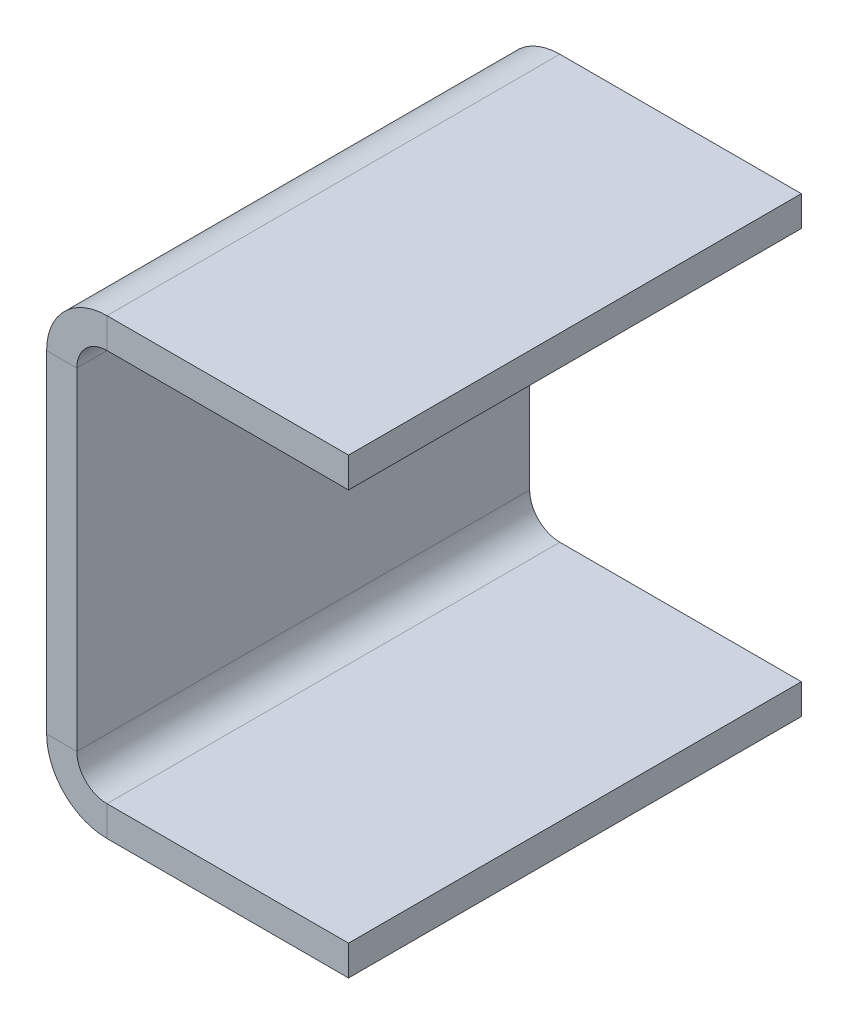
ISO-10303-21;
HEADER;
FILE_DESCRIPTION(('STEP AP214'),'2;1');
FILE_NAME('part.step','',(''),(''),'','','');
FILE_SCHEMA(('AUTOMOTIVE_DESIGN { 1 0 10303 214 1 1 1 1 }'));
ENDSEC;
DATA;
#1=APPLICATION_CONTEXT('core data for automotive mechanical design processes');
#2=APPLICATION_PROTOCOL_DEFINITION('international standard','automotive_design',2000,#1);
#3=PRODUCT_CONTEXT('',#1,'mechanical');
#4=PRODUCT('Part','Part','',(#3));
#5=PRODUCT_RELATED_PRODUCT_CATEGORY('part','',(#4));
#6=PRODUCT_DEFINITION_FORMATION('','',#4);
#7=PRODUCT_DEFINITION_CONTEXT('part definition',#1,'design');
#8=PRODUCT_DEFINITION('design','',#6,#7);
#9=PRODUCT_DEFINITION_SHAPE('','',#8);
#10=(LENGTH_UNIT() NAMED_UNIT(*) SI_UNIT(.MILLI.,.METRE.));
#11=(NAMED_UNIT(*) PLANE_ANGLE_UNIT() SI_UNIT($,.RADIAN.));
#12=(NAMED_UNIT(*) SI_UNIT($,.STERADIAN.) SOLID_ANGLE_UNIT());
#13=UNCERTAINTY_MEASURE_WITH_UNIT(LENGTH_MEASURE(1.E-05),#10,'distance_accuracy_value','');
#14=(GEOMETRIC_REPRESENTATION_CONTEXT(3) GLOBAL_UNCERTAINTY_ASSIGNED_CONTEXT((#13)) GLOBAL_UNIT_ASSIGNED_CONTEXT((#10,
#11,#12)) REPRESENTATION_CONTEXT('',''));
#15=CARTESIAN_POINT('',(0.,0.,0.));
#16=DIRECTION('',(0.,0.,1.));
#17=DIRECTION('',(1.,0.,0.));
#18=AXIS2_PLACEMENT_3D('',#15,#16,#17);
#19=CARTESIAN_POINT('',(4.,15.,15.));
#20=DIRECTION('',(0.,0.,1.));
#21=DIRECTION('',(1.,0.,0.));
#22=AXIS2_PLACEMENT_3D('',#19,#20,#21);
#23=PLANE('',#22);
#24=DIRECTION('',(0.,-1.,0.));
#25=VECTOR('',#24,1.);
#26=CARTESIAN_POINT('',(4.,15.,15.));
#27=LINE('',#26,#25);
#28=CARTESIAN_POINT('',(4.,15.,15.));
#29=VERTEX_POINT('',#28);
#30=CARTESIAN_POINT('',(4.,13.,15.));
#31=VERTEX_POINT('',#30);
#32=EDGE_CURVE('E11',#29,#31,#27,.T.);
#33=ORIENTED_EDGE('',*,*,#32,.F.);
#34=CARTESIAN_POINT('',(4.,11.,15.));
#35=DIRECTION('',(0.,0.,-1.));
#36=DIRECTION('',(-1.,0.,0.));
#37=AXIS2_PLACEMENT_3D('',#34,#35,#36);
#38=CIRCLE('',#37,4.);
#39=CARTESIAN_POINT('',(0.,11.,15.));
#40=VERTEX_POINT('',#39);
#41=EDGE_CURVE('E197',#29,#40,#38,.F.);
#42=ORIENTED_EDGE('',*,*,#41,.T.);
#43=DIRECTION('',(-1.,0.,0.));
#44=VECTOR('',#43,1.);
#45=CARTESIAN_POINT('',(2.,11.,15.));
#46=LINE('',#45,#44);
#47=CARTESIAN_POINT('',(2.,11.,15.));
#48=VERTEX_POINT('',#47);
#49=EDGE_CURVE('E38',#48,#40,#46,.T.);
#50=ORIENTED_EDGE('',*,*,#49,.F.);
#51=CARTESIAN_POINT('',(4.,11.,15.));
#52=DIRECTION('',(0.,0.,1.));
#53=DIRECTION('',(1.,0.,0.));
#54=AXIS2_PLACEMENT_3D('',#51,#52,#53);
#55=CIRCLE('',#54,2.);
#56=EDGE_CURVE('E185',#31,#48,#55,.T.);
#57=ORIENTED_EDGE('',*,*,#56,.F.);
#58=EDGE_LOOP('',(#33,#42,#50,#57));
#59=FACE_BOUND('',#58,.T.);
#60=ADVANCED_FACE('F31',(#59),#23,.T.);
#61=CARTESIAN_POINT('',(2.,11.,15.));
#62=DIRECTION('',(0.,0.,1.));
#63=DIRECTION('',(1.,0.,0.));
#64=AXIS2_PLACEMENT_3D('',#61,#62,#63);
#65=PLANE('',#64);
#66=DIRECTION('',(-1.,0.,0.));
#67=VECTOR('',#66,1.);
#68=CARTESIAN_POINT('',(20.,15.,15.));
#69=LINE('',#68,#67);
#70=CARTESIAN_POINT('',(20.,15.,15.));
#71=VERTEX_POINT('',#70);
#72=EDGE_CURVE('E194',#71,#29,#69,.T.);
#73=ORIENTED_EDGE('',*,*,#72,.T.);
#74=ORIENTED_EDGE('',*,*,#32,.T.);
#75=DIRECTION('',(1.,0.,0.));
#76=VECTOR('',#75,1.);
#77=CARTESIAN_POINT('',(20.,13.,15.));
#78=LINE('',#77,#76);
#79=CARTESIAN_POINT('',(20.,13.,15.));
#80=VERTEX_POINT('',#79);
#81=EDGE_CURVE('E188',#80,#31,#78,.F.);
#82=ORIENTED_EDGE('',*,*,#81,.F.);
#83=DIRECTION('',(0.,-1.,0.));
#84=VECTOR('',#83,1.);
#85=CARTESIAN_POINT('',(20.,15.,15.));
#86=LINE('',#85,#84);
#87=EDGE_CURVE('E191',#71,#80,#86,.T.);
#88=ORIENTED_EDGE('',*,*,#87,.F.);
#89=EDGE_LOOP('',(#73,#74,#82,#88));
#90=FACE_BOUND('',#89,.T.);
#91=ADVANCED_FACE('F281',(#90),#65,.T.);
#92=CARTESIAN_POINT('',(0.,11.,-15.));
#93=DIRECTION('',(0.,0.,-1.));
#94=DIRECTION('',(-1.,0.,0.));
#95=AXIS2_PLACEMENT_3D('',#92,#93,#94);
#96=PLANE('',#95);
#97=DIRECTION('',(1.,0.,0.));
#98=VECTOR('',#97,1.);
#99=CARTESIAN_POINT('',(0.,11.,-15.));
#100=LINE('',#99,#98);
#101=CARTESIAN_POINT('',(0.,11.,-15.));
#102=VERTEX_POINT('',#101);
#103=CARTESIAN_POINT('',(2.,11.,-15.));
#104=VERTEX_POINT('',#103);
#105=EDGE_CURVE('E238',#102,#104,#100,.T.);
#106=ORIENTED_EDGE('',*,*,#105,.F.);
#107=CARTESIAN_POINT('',(4.,11.,-15.));
#108=DIRECTION('',(0.,0.,-1.));
#109=DIRECTION('',(-1.,0.,0.));
#110=AXIS2_PLACEMENT_3D('',#107,#108,#109);
#111=CIRCLE('',#110,4.);
#112=CARTESIAN_POINT('',(4.,15.,-15.));
#113=VERTEX_POINT('',#112);
#114=EDGE_CURVE('E164',#113,#102,#111,.F.);
#115=ORIENTED_EDGE('',*,*,#114,.F.);
#116=DIRECTION('',(0.,1.,0.));
#117=VECTOR('',#116,1.);
#118=CARTESIAN_POINT('',(4.,13.,-15.));
#119=LINE('',#118,#117);
#120=CARTESIAN_POINT('',(4.,13.,-15.));
#121=VERTEX_POINT('',#120);
#122=EDGE_CURVE('E236',#121,#113,#119,.T.);
#123=ORIENTED_EDGE('',*,*,#122,.F.);
#124=CARTESIAN_POINT('',(4.,11.,-15.));
#125=DIRECTION('',(0.,0.,1.));
#126=DIRECTION('',(1.,0.,0.));
#127=AXIS2_PLACEMENT_3D('',#124,#125,#126);
#128=CIRCLE('',#127,2.);
#129=EDGE_CURVE('E152',#121,#104,#128,.T.);
#130=ORIENTED_EDGE('',*,*,#129,.T.);
#131=EDGE_LOOP('',(#106,#115,#123,#130));
#132=FACE_BOUND('',#131,.T.);
#133=ADVANCED_FACE('F291',(#132),#96,.T.);
#134=CARTESIAN_POINT('',(4.,13.,-15.));
#135=DIRECTION('',(0.,0.,-1.));
#136=DIRECTION('',(-1.,0.,0.));
#137=AXIS2_PLACEMENT_3D('',#134,#135,#136);
#138=PLANE('',#137);
#139=DIRECTION('',(0.,-1.,0.));
#140=VECTOR('',#139,1.);
#141=CARTESIAN_POINT('',(0.,15.,-15.));
#142=LINE('',#141,#140);
#143=CARTESIAN_POINT('',(0.,-11.,-15.));
#144=VERTEX_POINT('',#143);
#145=EDGE_CURVE('E167',#102,#144,#142,.T.);
#146=ORIENTED_EDGE('',*,*,#145,.F.);
#147=ORIENTED_EDGE('',*,*,#105,.T.);
#148=DIRECTION('',(0.,1.,0.));
#149=VECTOR('',#148,1.);
#150=CARTESIAN_POINT('',(2.,15.,-15.));
#151=LINE('',#150,#149);
#152=CARTESIAN_POINT('',(2.,-11.,-15.));
#153=VERTEX_POINT('',#152);
#154=EDGE_CURVE('E149',#104,#153,#151,.F.);
#155=ORIENTED_EDGE('',*,*,#154,.T.);
#156=DIRECTION('',(-1.,0.,0.));
#157=VECTOR('',#156,1.);
#158=CARTESIAN_POINT('',(2.,-11.,-15.));
#159=LINE('',#158,#157);
#160=EDGE_CURVE('E129',#153,#144,#159,.T.);
#161=ORIENTED_EDGE('',*,*,#160,.T.);
#162=EDGE_LOOP('',(#146,#147,#155,#161));
#163=FACE_BOUND('',#162,.T.);
#164=ADVANCED_FACE('F293',(#163),#138,.T.);
#165=CARTESIAN_POINT('',(0.,-11.,15.));
#166=DIRECTION('',(0.,0.,1.));
#167=DIRECTION('',(1.,0.,0.));
#168=AXIS2_PLACEMENT_3D('',#165,#166,#167);
#169=PLANE('',#168);
#170=DIRECTION('',(1.,0.,0.));
#171=VECTOR('',#170,1.);
#172=CARTESIAN_POINT('',(0.,-11.,15.));
#173=LINE('',#172,#171);
#174=CARTESIAN_POINT('',(0.,-11.,15.));
#175=VERTEX_POINT('',#174);
#176=CARTESIAN_POINT('',(2.,-11.,15.));
#177=VERTEX_POINT('',#176);
#178=EDGE_CURVE('E52',#175,#177,#173,.T.);
#179=ORIENTED_EDGE('',*,*,#178,.F.);
#180=CARTESIAN_POINT('',(4.,-11.,15.));
#181=DIRECTION('',(0.,0.,-1.));
#182=DIRECTION('',(-1.,0.,0.));
#183=AXIS2_PLACEMENT_3D('',#180,#181,#182);
#184=CIRCLE('',#183,4.);
#185=CARTESIAN_POINT('',(4.,-15.,15.));
#186=VERTEX_POINT('',#185);
#187=EDGE_CURVE('E202',#175,#186,#184,.F.);
#188=ORIENTED_EDGE('',*,*,#187,.T.);
#189=DIRECTION('',(0.,-1.,0.));
#190=VECTOR('',#189,1.);
#191=CARTESIAN_POINT('',(4.,-13.,15.));
#192=LINE('',#191,#190);
#193=CARTESIAN_POINT('',(4.,-13.,15.));
#194=VERTEX_POINT('',#193);
#195=EDGE_CURVE('E45',#194,#186,#192,.T.);
#196=ORIENTED_EDGE('',*,*,#195,.F.);
#197=CARTESIAN_POINT('',(4.,-11.,15.));
#198=DIRECTION('',(0.,0.,1.));
#199=DIRECTION('',(1.,0.,0.));
#200=AXIS2_PLACEMENT_3D('',#197,#198,#199);
#201=CIRCLE('',#200,2.);
#202=EDGE_CURVE('E179',#177,#194,#201,.T.);
#203=ORIENTED_EDGE('',*,*,#202,.F.);
#204=EDGE_LOOP('',(#179,#188,#196,#203));
#205=FACE_BOUND('',#204,.T.);
#206=ADVANCED_FACE('F259',(#205),#169,.T.);
#207=CARTESIAN_POINT('',(4.,-13.,15.));
#208=DIRECTION('',(0.,0.,1.));
#209=DIRECTION('',(1.,0.,0.));
#210=AXIS2_PLACEMENT_3D('',#207,#208,#209);
#211=PLANE('',#210);
#212=DIRECTION('',(0.,-1.,0.));
#213=VECTOR('',#212,1.);
#214=CARTESIAN_POINT('',(0.,15.,15.));
#215=LINE('',#214,#213);
#216=EDGE_CURVE('E200',#40,#175,#215,.T.);
#217=ORIENTED_EDGE('',*,*,#216,.T.);
#218=ORIENTED_EDGE('',*,*,#178,.T.);
#219=DIRECTION('',(0.,1.,0.));
#220=VECTOR('',#219,1.);
#221=CARTESIAN_POINT('',(2.,15.,15.));
#222=LINE('',#221,#220);
#223=EDGE_CURVE('E182',#48,#177,#222,.F.);
#224=ORIENTED_EDGE('',*,*,#223,.F.);
#225=ORIENTED_EDGE('',*,*,#49,.T.);
#226=EDGE_LOOP('',(#217,#218,#224,#225));
#227=FACE_BOUND('',#226,.T.);
#228=ADVANCED_FACE('F241',(#227),#211,.T.);
#229=CARTESIAN_POINT('',(4.,-15.,-15.));
#230=DIRECTION('',(0.,0.,-1.));
#231=DIRECTION('',(-1.,0.,0.));
#232=AXIS2_PLACEMENT_3D('',#229,#230,#231);
#233=PLANE('',#232);
#234=DIRECTION('',(0.,1.,0.));
#235=VECTOR('',#234,1.);
#236=CARTESIAN_POINT('',(4.,-15.,-15.));
#237=LINE('',#236,#235);
#238=CARTESIAN_POINT('',(4.,-15.,-15.));
#239=VERTEX_POINT('',#238);
#240=CARTESIAN_POINT('',(4.,-13.,-15.));
#241=VERTEX_POINT('',#240);
#242=EDGE_CURVE('E232',#239,#241,#237,.T.);
#243=ORIENTED_EDGE('',*,*,#242,.F.);
#244=CARTESIAN_POINT('',(4.,-11.,-15.));
#245=DIRECTION('',(0.,0.,-1.));
#246=DIRECTION('',(-1.,0.,0.));
#247=AXIS2_PLACEMENT_3D('',#244,#245,#246);
#248=CIRCLE('',#247,4.);
#249=EDGE_CURVE('E170',#144,#239,#248,.F.);
#250=ORIENTED_EDGE('',*,*,#249,.F.);
#251=ORIENTED_EDGE('',*,*,#160,.F.);
#252=CARTESIAN_POINT('',(4.,-11.,-15.));
#253=DIRECTION('',(0.,0.,1.));
#254=DIRECTION('',(1.,0.,0.));
#255=AXIS2_PLACEMENT_3D('',#252,#253,#254);
#256=CIRCLE('',#255,2.);
#257=EDGE_CURVE('E144',#153,#241,#256,.T.);
#258=ORIENTED_EDGE('',*,*,#257,.T.);
#259=EDGE_LOOP('',(#243,#250,#251,#258));
#260=FACE_BOUND('',#259,.T.);
#261=ADVANCED_FACE('F295',(#260),#233,.T.);
#262=CARTESIAN_POINT('',(2.,-11.,-15.));
#263=DIRECTION('',(0.,0.,-1.));
#264=DIRECTION('',(-1.,0.,0.));
#265=AXIS2_PLACEMENT_3D('',#262,#263,#264);
#266=PLANE('',#265);
#267=DIRECTION('',(1.,0.,0.));
#268=VECTOR('',#267,1.);
#269=CARTESIAN_POINT('',(0.,-15.,-15.));
#270=LINE('',#269,#268);
#271=CARTESIAN_POINT('',(20.,-15.,-15.));
#272=VERTEX_POINT('',#271);
#273=EDGE_CURVE('E134',#239,#272,#270,.T.);
#274=ORIENTED_EDGE('',*,*,#273,.F.);
#275=ORIENTED_EDGE('',*,*,#242,.T.);
#276=DIRECTION('',(1.,0.,0.));
#277=VECTOR('',#276,1.);
#278=CARTESIAN_POINT('',(0.,-13.,-15.));
#279=LINE('',#278,#277);
#280=CARTESIAN_POINT('',(20.,-13.,-15.));
#281=VERTEX_POINT('',#280);
#282=EDGE_CURVE('E142',#241,#281,#279,.T.);
#283=ORIENTED_EDGE('',*,*,#282,.T.);
#284=DIRECTION('',(0.,-1.,0.));
#285=VECTOR('',#284,1.);
#286=CARTESIAN_POINT('',(20.,-13.,-15.));
#287=LINE('',#286,#285);
#288=EDGE_CURVE('E123',#281,#272,#287,.T.);
#289=ORIENTED_EDGE('',*,*,#288,.T.);
#290=EDGE_LOOP('',(#274,#275,#283,#289));
#291=FACE_BOUND('',#290,.T.);
#292=ADVANCED_FACE('F140',(#291),#266,.T.);
#293=CARTESIAN_POINT('',(0.,-15.,15.));
#294=DIRECTION('',(0.,1.,0.));
#295=DIRECTION('',(0.,0.,1.));
#296=AXIS2_PLACEMENT_3D('',#293,#294,#295);
#297=PLANE('',#296);
#298=ORIENTED_EDGE('',*,*,#273,.T.);
#299=DIRECTION('',(0.,0.,-1.));
#300=VECTOR('',#299,1.);
#301=CARTESIAN_POINT('',(20.,-15.,15.));
#302=LINE('',#301,#300);
#303=CARTESIAN_POINT('',(20.,-15.,15.));
#304=VERTEX_POINT('',#303);
#305=EDGE_CURVE('E119',#304,#272,#302,.T.);
#306=ORIENTED_EDGE('',*,*,#305,.F.);
#307=DIRECTION('',(1.,0.,0.));
#308=VECTOR('',#307,1.);
#309=CARTESIAN_POINT('',(0.,-15.,15.));
#310=LINE('',#309,#308);
#311=EDGE_CURVE('E173',#186,#304,#310,.T.);
#312=ORIENTED_EDGE('',*,*,#311,.F.);
#313=DIRECTION('',(0.,0.,-1.));
#314=VECTOR('',#313,1.);
#315=CARTESIAN_POINT('',(4.,-15.,15.));
#316=LINE('',#315,#314);
#317=EDGE_CURVE('E137',#186,#239,#316,.T.);
#318=ORIENTED_EDGE('',*,*,#317,.T.);
#319=EDGE_LOOP('',(#298,#306,#312,#318));
#320=FACE_BOUND('',#319,.T.);
#321=ADVANCED_FACE('F135',(#320),#297,.F.);
#322=CARTESIAN_POINT('',(20.,-13.,15.));
#323=DIRECTION('',(1.,0.,0.));
#324=DIRECTION('',(0.,0.,-1.));
#325=AXIS2_PLACEMENT_3D('',#322,#323,#324);
#326=PLANE('',#325);
#327=ORIENTED_EDGE('',*,*,#288,.F.);
#328=DIRECTION('',(0.,0.,-1.));
#329=VECTOR('',#328,1.);
#330=CARTESIAN_POINT('',(20.,-13.,15.));
#331=LINE('',#330,#329);
#332=CARTESIAN_POINT('',(20.,-13.,15.));
#333=VERTEX_POINT('',#332);
#334=EDGE_CURVE('E130',#333,#281,#331,.T.);
#335=ORIENTED_EDGE('',*,*,#334,.F.);
#336=DIRECTION('',(0.,-1.,0.));
#337=VECTOR('',#336,1.);
#338=CARTESIAN_POINT('',(20.,-13.,15.));
#339=LINE('',#338,#337);
#340=EDGE_CURVE('E126',#333,#304,#339,.T.);
#341=ORIENTED_EDGE('',*,*,#340,.T.);
#342=ORIENTED_EDGE('',*,*,#305,.T.);
#343=EDGE_LOOP('',(#327,#335,#341,#342));
#344=FACE_BOUND('',#343,.T.);
#345=ADVANCED_FACE('F121',(#344),#326,.T.);
#346=CARTESIAN_POINT('',(0.,-13.,15.));
#347=DIRECTION('',(0.,1.,0.));
#348=DIRECTION('',(0.,0.,1.));
#349=AXIS2_PLACEMENT_3D('',#346,#347,#348);
#350=PLANE('',#349);
#351=ORIENTED_EDGE('',*,*,#282,.F.);
#352=DIRECTION('',(0.,0.,-1.));
#353=VECTOR('',#352,1.);
#354=CARTESIAN_POINT('',(4.,-13.,15.));
#355=LINE('',#354,#353);
#356=EDGE_CURVE('E227',#194,#241,#355,.T.);
#357=ORIENTED_EDGE('',*,*,#356,.F.);
#358=DIRECTION('',(1.,0.,0.));
#359=VECTOR('',#358,1.);
#360=CARTESIAN_POINT('',(0.,-13.,15.));
#361=LINE('',#360,#359);
#362=EDGE_CURVE('E176',#194,#333,#361,.T.);
#363=ORIENTED_EDGE('',*,*,#362,.T.);
#364=ORIENTED_EDGE('',*,*,#334,.T.);
#365=EDGE_LOOP('',(#351,#357,#363,#364));
#366=FACE_BOUND('',#365,.T.);
#367=ADVANCED_FACE('F262',(#366),#350,.T.);
#368=CARTESIAN_POINT('',(4.,-11.,15.));
#369=DIRECTION('',(0.,0.,-1.));
#370=DIRECTION('',(-1.,0.,0.));
#371=AXIS2_PLACEMENT_3D('',#368,#369,#370);
#372=CYLINDRICAL_SURFACE('',#371,2.);
#373=ORIENTED_EDGE('',*,*,#257,.F.);
#374=DIRECTION('',(0.,0.,-1.));
#375=VECTOR('',#374,1.);
#376=CARTESIAN_POINT('',(2.,-11.,15.));
#377=LINE('',#376,#375);
#378=EDGE_CURVE('E224',#177,#153,#377,.T.);
#379=ORIENTED_EDGE('',*,*,#378,.F.);
#380=ORIENTED_EDGE('',*,*,#202,.T.);
#381=ORIENTED_EDGE('',*,*,#356,.T.);
#382=EDGE_LOOP('',(#373,#379,#380,#381));
#383=FACE_BOUND('',#382,.T.);
#384=ADVANCED_FACE('F267',(#383),#372,.F.);
#385=CARTESIAN_POINT('',(2.,15.,15.));
#386=DIRECTION('',(1.,0.,0.));
#387=DIRECTION('',(0.,0.,-1.));
#388=AXIS2_PLACEMENT_3D('',#385,#386,#387);
#389=PLANE('',#388);
#390=ORIENTED_EDGE('',*,*,#154,.F.);
#391=DIRECTION('',(0.,0.,-1.));
#392=VECTOR('',#391,1.);
#393=CARTESIAN_POINT('',(2.,11.,15.));
#394=LINE('',#393,#392);
#395=EDGE_CURVE('E221',#48,#104,#394,.T.);
#396=ORIENTED_EDGE('',*,*,#395,.F.);
#397=ORIENTED_EDGE('',*,*,#223,.T.);
#398=ORIENTED_EDGE('',*,*,#378,.T.);
#399=EDGE_LOOP('',(#390,#396,#397,#398));
#400=FACE_BOUND('',#399,.T.);
#401=ADVANCED_FACE('F270',(#400),#389,.T.);
#402=CARTESIAN_POINT('',(4.,11.,15.));
#403=DIRECTION('',(0.,0.,-1.));
#404=DIRECTION('',(-1.,0.,0.));
#405=AXIS2_PLACEMENT_3D('',#402,#403,#404);
#406=CYLINDRICAL_SURFACE('',#405,2.);
#407=ORIENTED_EDGE('',*,*,#129,.F.);
#408=DIRECTION('',(0.,0.,-1.));
#409=VECTOR('',#408,1.);
#410=CARTESIAN_POINT('',(4.,13.,15.));
#411=LINE('',#410,#409);
#412=EDGE_CURVE('E218',#31,#121,#411,.T.);
#413=ORIENTED_EDGE('',*,*,#412,.F.);
#414=ORIENTED_EDGE('',*,*,#56,.T.);
#415=ORIENTED_EDGE('',*,*,#395,.T.);
#416=EDGE_LOOP('',(#407,#413,#414,#415));
#417=FACE_BOUND('',#416,.T.);
#418=ADVANCED_FACE('F273',(#417),#406,.F.);
#419=CARTESIAN_POINT('',(20.,13.,15.));
#420=DIRECTION('',(0.,-1.,0.));
#421=DIRECTION('',(0.,0.,-1.));
#422=AXIS2_PLACEMENT_3D('',#419,#420,#421);
#423=PLANE('',#422);
#424=DIRECTION('',(1.,0.,0.));
#425=VECTOR('',#424,1.);
#426=CARTESIAN_POINT('',(20.,13.,-15.));
#427=LINE('',#426,#425);
#428=CARTESIAN_POINT('',(20.,13.,-15.));
#429=VERTEX_POINT('',#428);
#430=EDGE_CURVE('E155',#429,#121,#427,.F.);
#431=ORIENTED_EDGE('',*,*,#430,.F.);
#432=DIRECTION('',(0.,0.,-1.));
#433=VECTOR('',#432,1.);
#434=CARTESIAN_POINT('',(20.,13.,15.));
#435=LINE('',#434,#433);
#436=EDGE_CURVE('E216',#80,#429,#435,.T.);
#437=ORIENTED_EDGE('',*,*,#436,.F.);
#438=ORIENTED_EDGE('',*,*,#81,.T.);
#439=ORIENTED_EDGE('',*,*,#412,.T.);
#440=EDGE_LOOP('',(#431,#437,#438,#439));
#441=FACE_BOUND('',#440,.T.);
#442=ADVANCED_FACE('F278',(#441),#423,.T.);
#443=CARTESIAN_POINT('',(20.,15.,15.));
#444=DIRECTION('',(1.,0.,0.));
#445=DIRECTION('',(0.,0.,-1.));
#446=AXIS2_PLACEMENT_3D('',#443,#444,#445);
#447=PLANE('',#446);
#448=DIRECTION('',(0.,-1.,0.));
#449=VECTOR('',#448,1.);
#450=CARTESIAN_POINT('',(20.,15.,-15.));
#451=LINE('',#450,#449);
#452=CARTESIAN_POINT('',(20.,15.,-15.));
#453=VERTEX_POINT('',#452);
#454=EDGE_CURVE('E158',#453,#429,#451,.T.);
#455=ORIENTED_EDGE('',*,*,#454,.F.);
#456=DIRECTION('',(0.,0.,-1.));
#457=VECTOR('',#456,1.);
#458=CARTESIAN_POINT('',(20.,15.,15.));
#459=LINE('',#458,#457);
#460=EDGE_CURVE('E214',#71,#453,#459,.T.);
#461=ORIENTED_EDGE('',*,*,#460,.F.);
#462=ORIENTED_EDGE('',*,*,#87,.T.);
#463=ORIENTED_EDGE('',*,*,#436,.T.);
#464=EDGE_LOOP('',(#455,#461,#462,#463));
#465=FACE_BOUND('',#464,.T.);
#466=ADVANCED_FACE('F284',(#465),#447,.T.);
#467=CARTESIAN_POINT('',(20.,15.,15.));
#468=DIRECTION('',(0.,-1.,0.));
#469=DIRECTION('',(0.,0.,-1.));
#470=AXIS2_PLACEMENT_3D('',#467,#468,#469);
#471=PLANE('',#470);
#472=DIRECTION('',(-1.,0.,0.));
#473=VECTOR('',#472,1.);
#474=CARTESIAN_POINT('',(20.,15.,-15.));
#475=LINE('',#474,#473);
#476=EDGE_CURVE('E161',#453,#113,#475,.T.);
#477=ORIENTED_EDGE('',*,*,#476,.T.);
#478=DIRECTION('',(0.,0.,-1.));
#479=VECTOR('',#478,1.);
#480=CARTESIAN_POINT('',(4.,15.,15.));
#481=LINE('',#480,#479);
#482=EDGE_CURVE('E211',#29,#113,#481,.T.);
#483=ORIENTED_EDGE('',*,*,#482,.F.);
#484=ORIENTED_EDGE('',*,*,#72,.F.);
#485=ORIENTED_EDGE('',*,*,#460,.T.);
#486=EDGE_LOOP('',(#477,#483,#484,#485));
#487=FACE_BOUND('',#486,.T.);
#488=ADVANCED_FACE('F289',(#487),#471,.F.);
#489=CARTESIAN_POINT('',(4.,11.,15.));
#490=DIRECTION('',(0.,0.,-1.));
#491=DIRECTION('',(-1.,0.,0.));
#492=AXIS2_PLACEMENT_3D('',#489,#490,#491);
#493=CYLINDRICAL_SURFACE('',#492,4.);
#494=ORIENTED_EDGE('',*,*,#114,.T.);
#495=DIRECTION('',(0.,0.,-1.));
#496=VECTOR('',#495,1.);
#497=CARTESIAN_POINT('',(0.,11.,15.));
#498=LINE('',#497,#496);
#499=EDGE_CURVE('E208',#40,#102,#498,.T.);
#500=ORIENTED_EDGE('',*,*,#499,.F.);
#501=ORIENTED_EDGE('',*,*,#41,.F.);
#502=ORIENTED_EDGE('',*,*,#482,.T.);
#503=EDGE_LOOP('',(#494,#500,#501,#502));
#504=FACE_BOUND('',#503,.T.);
#505=ADVANCED_FACE('F250',(#504),#493,.T.);
#506=CARTESIAN_POINT('',(0.,15.,15.));
#507=DIRECTION('',(1.,0.,0.));
#508=DIRECTION('',(0.,0.,-1.));
#509=AXIS2_PLACEMENT_3D('',#506,#507,#508);
#510=PLANE('',#509);
#511=ORIENTED_EDGE('',*,*,#145,.T.);
#512=DIRECTION('',(0.,0.,-1.));
#513=VECTOR('',#512,1.);
#514=CARTESIAN_POINT('',(0.,-11.,15.));
#515=LINE('',#514,#513);
#516=EDGE_CURVE('E205',#175,#144,#515,.T.);
#517=ORIENTED_EDGE('',*,*,#516,.F.);
#518=ORIENTED_EDGE('',*,*,#216,.F.);
#519=ORIENTED_EDGE('',*,*,#499,.T.);
#520=EDGE_LOOP('',(#511,#517,#518,#519));
#521=FACE_BOUND('',#520,.T.);
#522=ADVANCED_FACE('F254',(#521),#510,.F.);
#523=CARTESIAN_POINT('',(4.,-11.,15.));
#524=DIRECTION('',(0.,0.,-1.));
#525=DIRECTION('',(-1.,0.,0.));
#526=AXIS2_PLACEMENT_3D('',#523,#524,#525);
#527=CYLINDRICAL_SURFACE('',#526,4.);
#528=ORIENTED_EDGE('',*,*,#249,.T.);
#529=ORIENTED_EDGE('',*,*,#317,.F.);
#530=ORIENTED_EDGE('',*,*,#187,.F.);
#531=ORIENTED_EDGE('',*,*,#516,.T.);
#532=EDGE_LOOP('',(#528,#529,#530,#531));
#533=FACE_BOUND('',#532,.T.);
#534=ADVANCED_FACE('F258',(#533),#527,.T.);
#535=CARTESIAN_POINT('',(4.,-11.,15.));
#536=DIRECTION('',(0.,0.,1.));
#537=DIRECTION('',(1.,0.,0.));
#538=AXIS2_PLACEMENT_3D('',#535,#536,#537);
#539=PLANE('',#538);
#540=ORIENTED_EDGE('',*,*,#311,.T.);
#541=ORIENTED_EDGE('',*,*,#340,.F.);
#542=ORIENTED_EDGE('',*,*,#362,.F.);
#543=ORIENTED_EDGE('',*,*,#195,.T.);
#544=EDGE_LOOP('',(#540,#541,#542,#543));
#545=FACE_BOUND('',#544,.T.);
#546=ADVANCED_FACE('F265',(#545),#539,.T.);
#547=CARTESIAN_POINT('',(4.,-11.,-15.));
#548=DIRECTION('',(0.,0.,1.));
#549=DIRECTION('',(1.,0.,0.));
#550=AXIS2_PLACEMENT_3D('',#547,#548,#549);
#551=PLANE('',#550);
#552=ORIENTED_EDGE('',*,*,#430,.T.);
#553=ORIENTED_EDGE('',*,*,#122,.T.);
#554=ORIENTED_EDGE('',*,*,#476,.F.);
#555=ORIENTED_EDGE('',*,*,#454,.T.);
#556=EDGE_LOOP('',(#552,#553,#554,#555));
#557=FACE_BOUND('',#556,.T.);
#558=ADVANCED_FACE('F444',(#557),#551,.F.);
#559=CLOSED_SHELL('',(#60,#91,#133,#164,#206,#228,#261,#292,#321,#345,#367,#384,#401,#418,#442,
#466,#488,#505,#522,#534,#546,#558));
#560=MANIFOLD_SOLID_BREP('B2',#559);
#561=ADVANCED_BREP_SHAPE_REPRESENTATION('',(#18,#560),#14);
#562=SHAPE_DEFINITION_REPRESENTATION(#9,#561);
ENDSEC;
END-ISO-10303-21;
